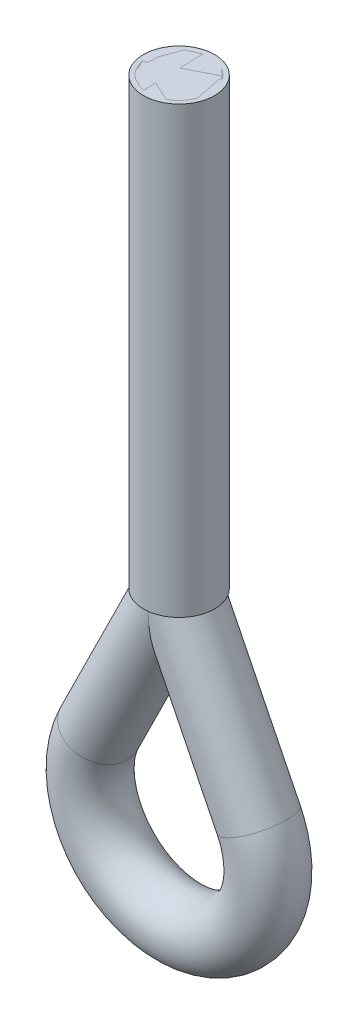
ISO-10303-21;
HEADER;
FILE_DESCRIPTION(('STEP AP214'),'2;1');
FILE_NAME('part.step','',(''),(''),'','','');
FILE_SCHEMA(('AUTOMOTIVE_DESIGN { 1 0 10303 214 1 1 1 1 }'));
ENDSEC;
DATA;
#1=APPLICATION_CONTEXT('core data for automotive mechanical design processes');
#2=APPLICATION_PROTOCOL_DEFINITION('international standard','automotive_design',2000,#1);
#3=PRODUCT_CONTEXT('',#1,'mechanical');
#4=PRODUCT('Part','Part','',(#3));
#5=PRODUCT_RELATED_PRODUCT_CATEGORY('part','',(#4));
#6=PRODUCT_DEFINITION_FORMATION('','',#4);
#7=PRODUCT_DEFINITION_CONTEXT('part definition',#1,'design');
#8=PRODUCT_DEFINITION('design','',#6,#7);
#9=PRODUCT_DEFINITION_SHAPE('','',#8);
#10=(LENGTH_UNIT() NAMED_UNIT(*) SI_UNIT(.MILLI.,.METRE.));
#11=(NAMED_UNIT(*) PLANE_ANGLE_UNIT() SI_UNIT($,.RADIAN.));
#12=(NAMED_UNIT(*) SI_UNIT($,.STERADIAN.) SOLID_ANGLE_UNIT());
#13=UNCERTAINTY_MEASURE_WITH_UNIT(LENGTH_MEASURE(1.E-05),#10,'distance_accuracy_value','');
#14=(GEOMETRIC_REPRESENTATION_CONTEXT(3) GLOBAL_UNCERTAINTY_ASSIGNED_CONTEXT((#13)) GLOBAL_UNIT_ASSIGNED_CONTEXT((#10,
#11,#12)) REPRESENTATION_CONTEXT('',''));
#15=CARTESIAN_POINT('',(0.,0.,0.));
#16=DIRECTION('',(0.,0.,1.));
#17=DIRECTION('',(1.,0.,0.));
#18=AXIS2_PLACEMENT_3D('',#15,#16,#17);
#19=CARTESIAN_POINT('',(0.,90.,0.));
#20=DIRECTION('',(0.,1.,0.));
#21=DIRECTION('',(0.,0.,1.));
#22=AXIS2_PLACEMENT_3D('',#19,#20,#21);
#23=CYLINDRICAL_SURFACE('',#22,16.);
#24=CARTESIAN_POINT('',(0.,90.,0.));
#25=DIRECTION('',(0.,1.,0.));
#26=DIRECTION('',(0.,0.,1.));
#27=AXIS2_PLACEMENT_3D('',#24,#25,#26);
#28=CIRCLE('',#27,16.);
#29=CARTESIAN_POINT('',(0.,90.,16.));
#30=VERTEX_POINT('',#29);
#31=EDGE_CURVE('E12',#30,#30,#28,.T.);
#32=ORIENTED_EDGE('',*,*,#31,.T.);
#33=EDGE_LOOP('',(#32));
#34=FACE_BOUND('',#33,.T.);
#35=CARTESIAN_POINT('',(0.,290.,0.));
#36=DIRECTION('',(0.,1.,0.));
#37=DIRECTION('',(0.,0.,1.));
#38=AXIS2_PLACEMENT_3D('',#35,#36,#37);
#39=CIRCLE('',#38,16.);
#40=CARTESIAN_POINT('',(0.,290.,16.));
#41=VERTEX_POINT('',#40);
#42=EDGE_CURVE('E58',#41,#41,#39,.T.);
#43=ORIENTED_EDGE('',*,*,#42,.F.);
#44=EDGE_LOOP('',(#43));
#45=FACE_BOUND('',#44,.T.);
#46=ADVANCED_FACE('F55',(#34,#45),#23,.T.);
#47=CARTESIAN_POINT('',(0.,90.,0.));
#48=DIRECTION('',(0.,1.,0.));
#49=DIRECTION('',(0.,0.,1.));
#50=AXIS2_PLACEMENT_3D('',#47,#48,#49);
#51=PLANE('',#50);
#52=ORIENTED_EDGE('',*,*,#31,.F.);
#53=EDGE_LOOP('',(#52));
#54=FACE_BOUND('',#53,.T.);
#55=ADVANCED_FACE('F71',(#54),#51,.F.);
#56=CARTESIAN_POINT('',(0.,290.,0.));
#57=DIRECTION('',(0.,1.,0.));
#58=DIRECTION('',(0.,0.,1.));
#59=AXIS2_PLACEMENT_3D('',#56,#57,#58);
#60=PLANE('',#59);
#61=ORIENTED_EDGE('',*,*,#42,.T.);
#62=EDGE_LOOP('',(#61));
#63=FACE_BOUND('',#62,.T.);
#64=ADVANCED_FACE('F68',(#63),#60,.T.);
#65=CLOSED_SHELL('',(#46,#55,#64));
#66=MANIFOLD_SOLID_BREP('B2',#65);
#67=CARTESIAN_POINT('',(0.,90.,0.));
#68=DIRECTION('',(-0.444444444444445,-0.895806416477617,0.));
#69=DIRECTION('',(0.895806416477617,-0.444444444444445,0.));
#70=AXIS2_PLACEMENT_3D('',#67,#68,#69);
#71=CYLINDRICAL_SURFACE('',#70,14.);
#72=CARTESIAN_POINT('',(-35.8322566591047,17.7777777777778,0.));
#73=DIRECTION('',(-0.444444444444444,-0.895806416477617,0.));
#74=DIRECTION('',(0.895806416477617,-0.444444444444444,0.));
#75=AXIS2_PLACEMENT_3D('',#72,#73,#74);
#76=CIRCLE('',#75,14.);
#77=CARTESIAN_POINT('',(-35.8322566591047,17.7777777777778,14.));
#78=VERTEX_POINT('',#77);
#79=CARTESIAN_POINT('',(-35.8322566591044,17.7777777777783,-14.));
#80=VERTEX_POINT('',#79);
#81=EDGE_CURVE('E155',#78,#80,#76,.T.);
#82=ORIENTED_EDGE('',*,*,#81,.F.);
#83=CARTESIAN_POINT('',(-35.8322566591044,17.7777777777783,0.));
#84=DIRECTION('',(0.444444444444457,0.895806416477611,0.));
#85=DIRECTION('',(-0.895806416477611,0.444444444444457,0.));
#86=AXIS2_PLACEMENT_3D('',#83,#84,#85);
#87=CIRCLE('',#86,14.);
#88=EDGE_CURVE('E151',#78,#80,#87,.T.);
#89=ORIENTED_EDGE('',*,*,#88,.T.);
#90=EDGE_LOOP('',(#82,#89));
#91=FACE_BOUND('',#90,.T.);
#92=CARTESIAN_POINT('',(0.,90.,0.));
#93=DIRECTION('',(-1.,0.,0.));
#94=DIRECTION('',(0.,1.,0.));
#95=AXIS2_PLACEMENT_3D('',#92,#93,#94);
#96=ELLIPSE('',#95,31.5,14.);
#97=CARTESIAN_POINT('',(-1.40512601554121E-13,87.7673747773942,-13.9647908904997));
#98=VERTEX_POINT('',#97);
#99=CARTESIAN_POINT('',(0.,87.7673747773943,13.9647908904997));
#100=VERTEX_POINT('',#99);
#101=EDGE_CURVE('E166',#98,#100,#96,.T.);
#102=ORIENTED_EDGE('',*,*,#101,.T.);
#103=CARTESIAN_POINT('',(-1.46938775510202,87.0383542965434,0.));
#104=DIRECTION('',(0.444444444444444,-0.895806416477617,0.));
#105=DIRECTION('',(-0.895806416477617,-0.444444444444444,0.));
#106=AXIS2_PLACEMENT_3D('',#103,#104,#105);
#107=ELLIPSE('',#106,23.1428571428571,14.);
#108=CARTESIAN_POINT('',(3.05598569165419,89.2835682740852,13.6623918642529));
#109=VERTEX_POINT('',#108);
#110=EDGE_CURVE('E53',#100,#109,#107,.F.);
#111=ORIENTED_EDGE('',*,*,#110,.T.);
#112=CARTESIAN_POINT('',(0.,90.,0.));
#113=DIRECTION('',(0.228247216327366,0.973603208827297,0.));
#114=DIRECTION('',(-0.973603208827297,0.228247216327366,0.));
#115=AXIS2_PLACEMENT_3D('',#112,#113,#114);
#116=ELLIPSE('',#115,14.3795746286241,14.);
#117=CARTESIAN_POINT('',(3.05598569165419,89.2835682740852,-13.6623918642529));
#118=VERTEX_POINT('',#117);
#119=EDGE_CURVE('E123',#118,#109,#116,.T.);
#120=ORIENTED_EDGE('',*,*,#119,.F.);
#121=EDGE_CURVE('E109',#118,#98,#107,.F.);
#122=ORIENTED_EDGE('',*,*,#121,.T.);
#123=EDGE_LOOP('',(#102,#111,#120,#122));
#124=FACE_BOUND('',#123,.T.);
#125=ADVANCED_FACE('F105',(#91,#124),#71,.T.);
#126=CARTESIAN_POINT('',(0.,90.,0.));
#127=DIRECTION('',(0.228247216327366,0.973603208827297,0.));
#128=DIRECTION('',(-0.973603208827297,0.228247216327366,0.));
#129=AXIS2_PLACEMENT_3D('',#126,#127,#128);
#130=PLANE('',#129);
#131=DIRECTION('',(0.,0.,1.));
#132=VECTOR('',#131,1.);
#133=CARTESIAN_POINT('',(3.05598569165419,89.2835682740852,0.));
#134=LINE('',#133,#132);
#135=EDGE_CURVE('E176',#118,#109,#134,.T.);
#136=ORIENTED_EDGE('',*,*,#135,.F.);
#137=ORIENTED_EDGE('',*,*,#119,.T.);
#138=EDGE_LOOP('',(#136,#137));
#139=FACE_BOUND('',#138,.T.);
#140=ADVANCED_FACE('F193',(#139),#130,.T.);
#141=CARTESIAN_POINT('',(0.,0.,0.));
#142=DIRECTION('',(0.,0.,1.));
#143=DIRECTION('',(1.,0.,0.));
#144=AXIS2_PLACEMENT_3D('',#141,#142,#143);
#145=TOROIDAL_SURFACE('',#144,40.,14.);
#146=ORIENTED_EDGE('',*,*,#88,.F.);
#147=ORIENTED_EDGE('',*,*,#81,.T.);
#148=EDGE_LOOP('',(#146,#147));
#149=FACE_BOUND('',#148,.T.);
#150=CARTESIAN_POINT('',(35.8322566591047,17.7777777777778,0.));
#151=DIRECTION('',(-0.444444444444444,0.895806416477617,0.));
#152=DIRECTION('',(-0.895806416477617,-0.444444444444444,0.));
#153=AXIS2_PLACEMENT_3D('',#150,#151,#152);
#154=CIRCLE('',#153,14.);
#155=CARTESIAN_POINT('',(35.8322566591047,17.7777777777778,14.));
#156=VERTEX_POINT('',#155);
#157=CARTESIAN_POINT('',(35.8322566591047,17.7777777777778,-14.));
#158=VERTEX_POINT('',#157);
#159=EDGE_CURVE('E132',#156,#158,#154,.T.);
#160=ORIENTED_EDGE('',*,*,#159,.F.);
#161=CARTESIAN_POINT('',(35.8322566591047,17.7777777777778,0.));
#162=DIRECTION('',(0.444444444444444,-0.895806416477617,0.));
#163=DIRECTION('',(0.895806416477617,0.444444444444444,0.));
#164=AXIS2_PLACEMENT_3D('',#161,#162,#163);
#165=CIRCLE('',#164,14.);
#166=EDGE_CURVE('E174',#156,#158,#165,.T.);
#167=ORIENTED_EDGE('',*,*,#166,.T.);
#168=EDGE_LOOP('',(#160,#167));
#169=FACE_BOUND('',#168,.T.);
#170=ADVANCED_FACE('F153',(#149,#169),#145,.T.);
#171=CARTESIAN_POINT('',(35.8322566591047,17.7777777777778,0.));
#172=DIRECTION('',(-0.444444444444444,0.895806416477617,0.));
#173=DIRECTION('',(-0.895806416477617,-0.444444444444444,0.));
#174=AXIS2_PLACEMENT_3D('',#171,#172,#173);
#175=CYLINDRICAL_SURFACE('',#174,14.);
#176=ORIENTED_EDGE('',*,*,#166,.F.);
#177=ORIENTED_EDGE('',*,*,#159,.T.);
#178=EDGE_LOOP('',(#176,#177));
#179=FACE_BOUND('',#178,.T.);
#180=ORIENTED_EDGE('',*,*,#101,.F.);
#181=CARTESIAN_POINT('',(0.888888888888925,88.2083871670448,0.));
#182=DIRECTION('',(0.444444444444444,-0.895806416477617,0.));
#183=DIRECTION('',(0.,0.,1.));
#184=AXIS2_PLACEMENT_3D('',#181,#182,#183);
#185=CIRCLE('',#184,14.);
#186=EDGE_CURVE('E170',#98,#100,#185,.T.);
#187=ORIENTED_EDGE('',*,*,#186,.T.);
#188=EDGE_LOOP('',(#180,#187));
#189=FACE_BOUND('',#188,.T.);
#190=ADVANCED_FACE('F107',(#179,#189),#175,.T.);
#191=CARTESIAN_POINT('',(0.888888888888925,88.2083871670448,0.));
#192=DIRECTION('',(0.444444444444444,-0.895806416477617,0.));
#193=DIRECTION('',(0.,0.,1.));
#194=AXIS2_PLACEMENT_3D('',#191,#192,#193);
#195=PLANE('',#194);
#196=ORIENTED_EDGE('',*,*,#110,.F.);
#197=ORIENTED_EDGE('',*,*,#186,.F.);
#198=ORIENTED_EDGE('',*,*,#121,.F.);
#199=ORIENTED_EDGE('',*,*,#135,.T.);
#200=EDGE_LOOP('',(#196,#197,#198,#199));
#201=FACE_BOUND('',#200,.T.);
#202=ADVANCED_FACE('F186',(#201),#195,.F.);
#203=CLOSED_SHELL('',(#125,#140,#170,#190,#202));
#204=MANIFOLD_SOLID_BREP('B7',#203);
#205=CARTESIAN_POINT('',(0.,290.,0.));
#206=DIRECTION('',(0.,-1.,0.));
#207=DIRECTION('',(0.,0.,-1.));
#208=AXIS2_PLACEMENT_3D('',#205,#206,#207);
#209=CYLINDRICAL_SURFACE('',#208,14.);
#210=CARTESIAN_POINT('',(0.,290.,0.));
#211=DIRECTION('',(0.,1.,0.));
#212=DIRECTION('',(0.,0.,1.));
#213=AXIS2_PLACEMENT_3D('',#210,#211,#212);
#214=CIRCLE('',#213,14.);
#215=CARTESIAN_POINT('',(0.,290.,14.));
#216=VERTEX_POINT('',#215);
#217=EDGE_CURVE('E264',#216,#216,#214,.T.);
#218=ORIENTED_EDGE('',*,*,#217,.F.);
#219=EDGE_LOOP('',(#218));
#220=FACE_BOUND('',#219,.T.);
#221=CARTESIAN_POINT('',(0.,90.,0.));
#222=DIRECTION('',(-0.228247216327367,-0.973603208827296,0.));
#223=DIRECTION('',(0.973603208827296,-0.228247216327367,0.));
#224=AXIS2_PLACEMENT_3D('',#221,#222,#223);
#225=ELLIPSE('',#224,14.3795746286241,14.);
#226=CARTESIAN_POINT('',(14.,86.717902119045,0.));
#227=VERTEX_POINT('',#226);
#228=EDGE_CURVE('E104',#227,#227,#225,.T.);
#229=ORIENTED_EDGE('',*,*,#228,.F.);
#230=EDGE_LOOP('',(#229));
#231=FACE_BOUND('',#230,.T.);
#232=ADVANCED_FACE('F256',(#220,#231),#209,.T.);
#233=CARTESIAN_POINT('',(0.,290.,0.));
#234=DIRECTION('',(0.,1.,0.));
#235=DIRECTION('',(0.,0.,1.));
#236=AXIS2_PLACEMENT_3D('',#233,#234,#235);
#237=PLANE('',#236);
#238=ORIENTED_EDGE('',*,*,#217,.T.);
#239=EDGE_LOOP('',(#238));
#240=FACE_BOUND('',#239,.T.);
#241=ADVANCED_FACE('F270',(#240),#237,.T.);
#242=CARTESIAN_POINT('',(0.,90.,0.));
#243=DIRECTION('',(-0.228247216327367,-0.973603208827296,0.));
#244=DIRECTION('',(0.973603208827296,-0.228247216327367,0.));
#245=AXIS2_PLACEMENT_3D('',#242,#243,#244);
#246=PLANE('',#245);
#247=ORIENTED_EDGE('',*,*,#228,.T.);
#248=EDGE_LOOP('',(#247));
#249=FACE_BOUND('',#248,.T.);
#250=ADVANCED_FACE('F258',(#249),#246,.T.);
#251=CLOSED_SHELL('',(#232,#241,#250));
#252=MANIFOLD_SOLID_BREP('B47',#251);
#253=ADVANCED_BREP_SHAPE_REPRESENTATION('',(#18,#66,#204,#252),#14);
#254=SHAPE_DEFINITION_REPRESENTATION(#9,#253);
ENDSEC;
END-ISO-10303-21;
